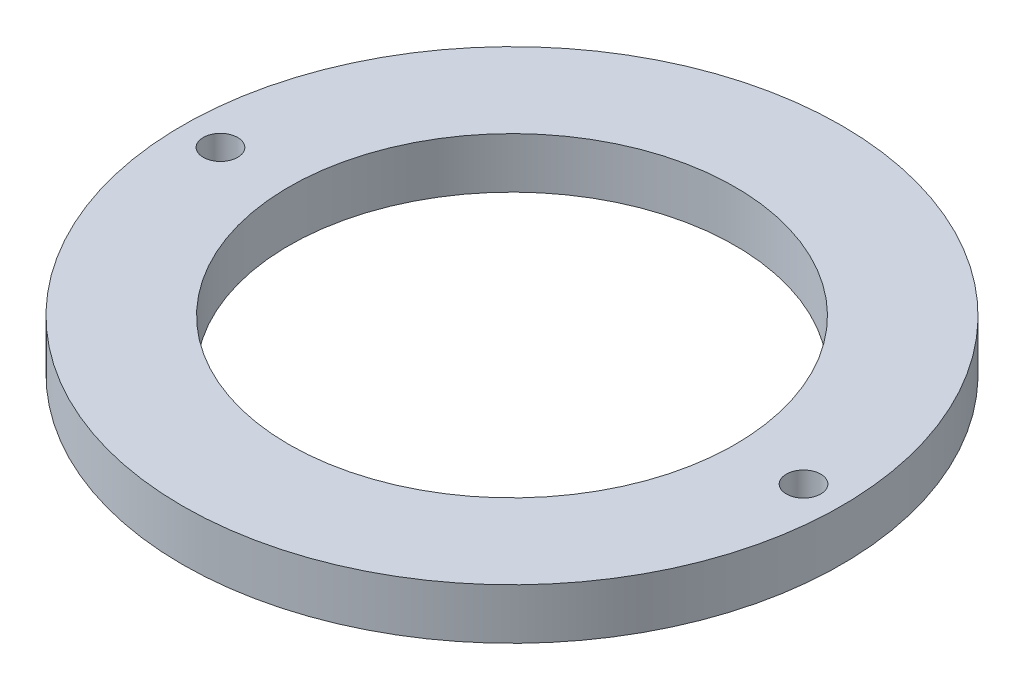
ISO-10303-21;
HEADER;
FILE_DESCRIPTION(('STEP AP214'),'2;1');
FILE_NAME('part.step','',(''),(''),'','','');
FILE_SCHEMA(('AUTOMOTIVE_DESIGN { 1 0 10303 214 1 1 1 1 }'));
ENDSEC;
DATA;
#1=APPLICATION_CONTEXT('core data for automotive mechanical design processes');
#2=APPLICATION_PROTOCOL_DEFINITION('international standard','automotive_design',2000,#1);
#3=PRODUCT_CONTEXT('',#1,'mechanical');
#4=PRODUCT('Part','Part','',(#3));
#5=PRODUCT_RELATED_PRODUCT_CATEGORY('part','',(#4));
#6=PRODUCT_DEFINITION_FORMATION('','',#4);
#7=PRODUCT_DEFINITION_CONTEXT('part definition',#1,'design');
#8=PRODUCT_DEFINITION('design','',#6,#7);
#9=PRODUCT_DEFINITION_SHAPE('','',#8);
#10=(LENGTH_UNIT() NAMED_UNIT(*) SI_UNIT(.MILLI.,.METRE.));
#11=(NAMED_UNIT(*) PLANE_ANGLE_UNIT() SI_UNIT($,.RADIAN.));
#12=(NAMED_UNIT(*) SI_UNIT($,.STERADIAN.) SOLID_ANGLE_UNIT());
#13=UNCERTAINTY_MEASURE_WITH_UNIT(LENGTH_MEASURE(1.E-05),#10,'distance_accuracy_value','');
#14=(GEOMETRIC_REPRESENTATION_CONTEXT(3) GLOBAL_UNCERTAINTY_ASSIGNED_CONTEXT((#13)) GLOBAL_UNIT_ASSIGNED_CONTEXT((#10,
#11,#12)) REPRESENTATION_CONTEXT('',''));
#15=CARTESIAN_POINT('',(0.,0.,0.));
#16=DIRECTION('',(0.,0.,1.));
#17=DIRECTION('',(1.,0.,0.));
#18=AXIS2_PLACEMENT_3D('',#15,#16,#17);
#19=CARTESIAN_POINT('',(0.,10.,0.));
#20=DIRECTION('',(0.,1.,0.));
#21=DIRECTION('',(0.,0.,1.));
#22=AXIS2_PLACEMENT_3D('',#19,#20,#21);
#23=PLANE('',#22);
#24=CARTESIAN_POINT('',(57.5,10.,0.));
#25=DIRECTION('',(0.,1.,0.));
#26=DIRECTION('',(0.,0.,1.));
#27=AXIS2_PLACEMENT_3D('',#24,#25,#26);
#28=CIRCLE('',#27,3.4);
#29=CARTESIAN_POINT('',(57.5,10.,3.39999999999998));
#30=VERTEX_POINT('',#29);
#31=EDGE_CURVE('E48',#30,#30,#28,.T.);
#32=ORIENTED_EDGE('',*,*,#31,.F.);
#33=EDGE_LOOP('',(#32));
#34=FACE_BOUND('',#33,.T.);
#35=CARTESIAN_POINT('',(0.,10.,0.));
#36=DIRECTION('',(0.,1.,0.));
#37=DIRECTION('',(0.,0.,1.));
#38=AXIS2_PLACEMENT_3D('',#35,#36,#37);
#39=CIRCLE('',#38,65.);
#40=CARTESIAN_POINT('',(0.,10.,65.));
#41=VERTEX_POINT('',#40);
#42=EDGE_CURVE('E10',#41,#41,#39,.T.);
#43=ORIENTED_EDGE('',*,*,#42,.T.);
#44=EDGE_LOOP('',(#43));
#45=FACE_BOUND('',#44,.T.);
#46=CARTESIAN_POINT('',(0.,10.,0.));
#47=DIRECTION('',(0.,1.,0.));
#48=DIRECTION('',(0.,0.,1.));
#49=AXIS2_PLACEMENT_3D('',#46,#47,#48);
#50=CIRCLE('',#49,44.);
#51=CARTESIAN_POINT('',(0.,10.,44.));
#52=VERTEX_POINT('',#51);
#53=EDGE_CURVE('E39',#52,#52,#50,.T.);
#54=ORIENTED_EDGE('',*,*,#53,.F.);
#55=EDGE_LOOP('',(#54));
#56=FACE_BOUND('',#55,.T.);
#57=CARTESIAN_POINT('',(-57.5,10.,0.));
#58=DIRECTION('',(0.,1.,0.));
#59=DIRECTION('',(0.,0.,1.));
#60=AXIS2_PLACEMENT_3D('',#57,#58,#59);
#61=CIRCLE('',#60,3.4);
#62=CARTESIAN_POINT('',(-57.5,10.,3.4));
#63=VERTEX_POINT('',#62);
#64=EDGE_CURVE('E54',#63,#63,#61,.T.);
#65=ORIENTED_EDGE('',*,*,#64,.F.);
#66=EDGE_LOOP('',(#65));
#67=FACE_BOUND('',#66,.T.);
#68=ADVANCED_FACE('F28',(#34,#45,#56,#67),#23,.T.);
#69=CARTESIAN_POINT('',(0.,0.,0.));
#70=DIRECTION('',(0.,1.,0.));
#71=DIRECTION('',(0.,0.,1.));
#72=AXIS2_PLACEMENT_3D('',#69,#70,#71);
#73=PLANE('',#72);
#74=CARTESIAN_POINT('',(57.5,0.,0.));
#75=DIRECTION('',(0.,1.,0.));
#76=DIRECTION('',(0.,0.,1.));
#77=AXIS2_PLACEMENT_3D('',#74,#75,#76);
#78=CIRCLE('',#77,3.4);
#79=CARTESIAN_POINT('',(57.5,0.,3.39999999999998));
#80=VERTEX_POINT('',#79);
#81=EDGE_CURVE('E51',#80,#80,#78,.T.);
#82=ORIENTED_EDGE('',*,*,#81,.T.);
#83=EDGE_LOOP('',(#82));
#84=FACE_BOUND('',#83,.T.);
#85=CARTESIAN_POINT('',(0.,0.,0.));
#86=DIRECTION('',(0.,1.,0.));
#87=DIRECTION('',(0.,0.,1.));
#88=AXIS2_PLACEMENT_3D('',#85,#86,#87);
#89=CIRCLE('',#88,65.);
#90=CARTESIAN_POINT('',(0.,0.,65.));
#91=VERTEX_POINT('',#90);
#92=EDGE_CURVE('E35',#91,#91,#89,.T.);
#93=ORIENTED_EDGE('',*,*,#92,.F.);
#94=EDGE_LOOP('',(#93));
#95=FACE_BOUND('',#94,.T.);
#96=CARTESIAN_POINT('',(0.,0.,0.));
#97=DIRECTION('',(0.,1.,0.));
#98=DIRECTION('',(0.,0.,1.));
#99=AXIS2_PLACEMENT_3D('',#96,#97,#98);
#100=CIRCLE('',#99,44.);
#101=CARTESIAN_POINT('',(0.,0.,44.));
#102=VERTEX_POINT('',#101);
#103=EDGE_CURVE('E43',#102,#102,#100,.T.);
#104=ORIENTED_EDGE('',*,*,#103,.T.);
#105=EDGE_LOOP('',(#104));
#106=FACE_BOUND('',#105,.T.);
#107=CARTESIAN_POINT('',(-57.5,0.,0.));
#108=DIRECTION('',(0.,1.,0.));
#109=DIRECTION('',(0.,0.,1.));
#110=AXIS2_PLACEMENT_3D('',#107,#108,#109);
#111=CIRCLE('',#110,3.4);
#112=CARTESIAN_POINT('',(-57.5,0.,3.4));
#113=VERTEX_POINT('',#112);
#114=EDGE_CURVE('E57',#113,#113,#111,.T.);
#115=ORIENTED_EDGE('',*,*,#114,.T.);
#116=EDGE_LOOP('',(#115));
#117=FACE_BOUND('',#116,.T.);
#118=ADVANCED_FACE('F61',(#84,#95,#106,#117),#73,.F.);
#119=CARTESIAN_POINT('',(0.,10.,0.));
#120=DIRECTION('',(0.,-1.,0.));
#121=DIRECTION('',(0.,0.,-1.));
#122=AXIS2_PLACEMENT_3D('',#119,#120,#121);
#123=CYLINDRICAL_SURFACE('',#122,65.);
#124=ORIENTED_EDGE('',*,*,#42,.F.);
#125=EDGE_LOOP('',(#124));
#126=FACE_BOUND('',#125,.T.);
#127=ORIENTED_EDGE('',*,*,#92,.T.);
#128=EDGE_LOOP('',(#127));
#129=FACE_BOUND('',#128,.T.);
#130=ADVANCED_FACE('F30',(#126,#129),#123,.T.);
#131=CARTESIAN_POINT('',(0.,10.,0.));
#132=DIRECTION('',(0.,-1.,0.));
#133=DIRECTION('',(0.,0.,-1.));
#134=AXIS2_PLACEMENT_3D('',#131,#132,#133);
#135=CYLINDRICAL_SURFACE('',#134,44.);
#136=ORIENTED_EDGE('',*,*,#53,.T.);
#137=EDGE_LOOP('',(#136));
#138=FACE_BOUND('',#137,.T.);
#139=ORIENTED_EDGE('',*,*,#103,.F.);
#140=EDGE_LOOP('',(#139));
#141=FACE_BOUND('',#140,.T.);
#142=ADVANCED_FACE('F71',(#138,#141),#135,.F.);
#143=CARTESIAN_POINT('',(57.5,10.,0.));
#144=DIRECTION('',(0.,-1.,0.));
#145=DIRECTION('',(0.,0.,-1.));
#146=AXIS2_PLACEMENT_3D('',#143,#144,#145);
#147=CYLINDRICAL_SURFACE('',#146,3.4);
#148=ORIENTED_EDGE('',*,*,#31,.T.);
#149=EDGE_LOOP('',(#148));
#150=FACE_BOUND('',#149,.T.);
#151=ORIENTED_EDGE('',*,*,#81,.F.);
#152=EDGE_LOOP('',(#151));
#153=FACE_BOUND('',#152,.T.);
#154=ADVANCED_FACE('F65',(#150,#153),#147,.F.);
#155=CARTESIAN_POINT('',(-57.5,10.,0.));
#156=DIRECTION('',(0.,-1.,0.));
#157=DIRECTION('',(0.,0.,-1.));
#158=AXIS2_PLACEMENT_3D('',#155,#156,#157);
#159=CYLINDRICAL_SURFACE('',#158,3.4);
#160=ORIENTED_EDGE('',*,*,#64,.T.);
#161=EDGE_LOOP('',(#160));
#162=FACE_BOUND('',#161,.T.);
#163=ORIENTED_EDGE('',*,*,#114,.F.);
#164=EDGE_LOOP('',(#163));
#165=FACE_BOUND('',#164,.T.);
#166=ADVANCED_FACE('F63',(#162,#165),#159,.F.);
#167=CLOSED_SHELL('',(#68,#118,#130,#142,#154,#166));
#168=MANIFOLD_SOLID_BREP('B2',#167);
#169=ADVANCED_BREP_SHAPE_REPRESENTATION('',(#18,#168),#14);
#170=SHAPE_DEFINITION_REPRESENTATION(#9,#169);
ENDSEC;
END-ISO-10303-21;
